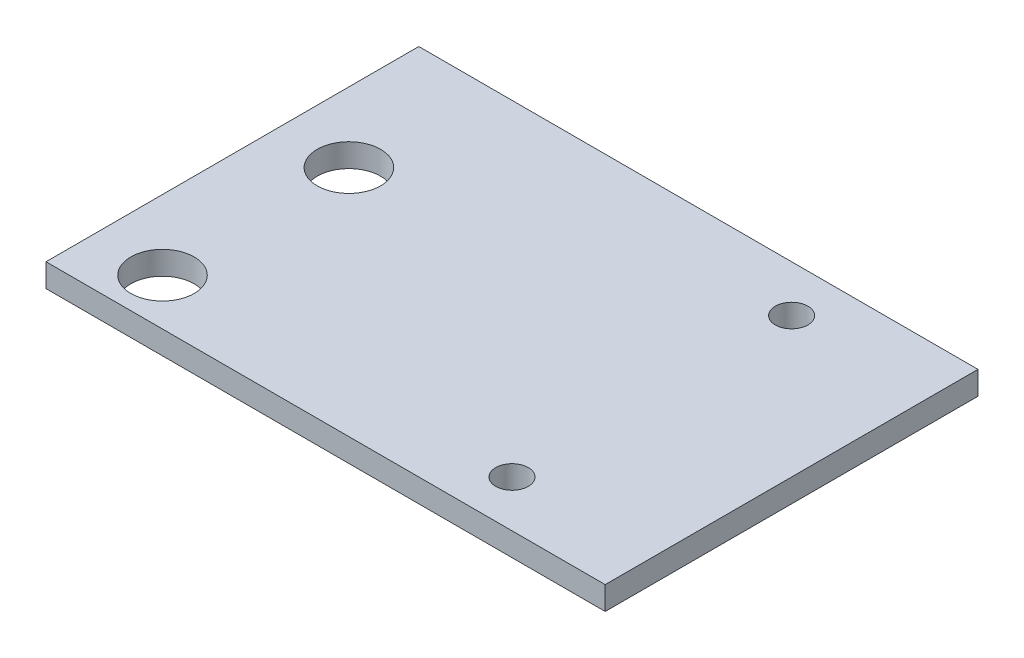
ISO-10303-21;
HEADER;
FILE_DESCRIPTION(('STEP AP214'),'2;1');
FILE_NAME('part.step','',(''),(''),'','','');
FILE_SCHEMA(('AUTOMOTIVE_DESIGN { 1 0 10303 214 1 1 1 1 }'));
ENDSEC;
DATA;
#1=APPLICATION_CONTEXT('core data for automotive mechanical design processes');
#2=APPLICATION_PROTOCOL_DEFINITION('international standard','automotive_design',2000,#1);
#3=PRODUCT_CONTEXT('',#1,'mechanical');
#4=PRODUCT('Part','Part','',(#3));
#5=PRODUCT_RELATED_PRODUCT_CATEGORY('part','',(#4));
#6=PRODUCT_DEFINITION_FORMATION('','',#4);
#7=PRODUCT_DEFINITION_CONTEXT('part definition',#1,'design');
#8=PRODUCT_DEFINITION('design','',#6,#7);
#9=PRODUCT_DEFINITION_SHAPE('','',#8);
#10=(LENGTH_UNIT() NAMED_UNIT(*) SI_UNIT(.MILLI.,.METRE.));
#11=(NAMED_UNIT(*) PLANE_ANGLE_UNIT() SI_UNIT($,.RADIAN.));
#12=(NAMED_UNIT(*) SI_UNIT($,.STERADIAN.) SOLID_ANGLE_UNIT());
#13=UNCERTAINTY_MEASURE_WITH_UNIT(LENGTH_MEASURE(1.E-05),#10,'distance_accuracy_value','');
#14=(GEOMETRIC_REPRESENTATION_CONTEXT(3) GLOBAL_UNCERTAINTY_ASSIGNED_CONTEXT((#13)) GLOBAL_UNIT_ASSIGNED_CONTEXT((#10,
#11,#12)) REPRESENTATION_CONTEXT('',''));
#15=CARTESIAN_POINT('',(0.,0.,0.));
#16=DIRECTION('',(0.,0.,1.));
#17=DIRECTION('',(1.,0.,0.));
#18=AXIS2_PLACEMENT_3D('',#15,#16,#17);
#19=CARTESIAN_POINT('',(0.,-2.5,-40.));
#20=DIRECTION('',(0.,-1.,0.));
#21=DIRECTION('',(0.,0.,-1.));
#22=AXIS2_PLACEMENT_3D('',#19,#20,#21);
#23=PLANE('',#22);
#24=CARTESIAN_POINT('',(45.,-2.49999999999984,-35.0000000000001));
#25=DIRECTION('',(0.,-1.,0.));
#26=DIRECTION('',(0.,0.,-1.));
#27=AXIS2_PLACEMENT_3D('',#24,#25,#26);
#28=CIRCLE('',#27,1.75);
#29=CARTESIAN_POINT('',(45.,-2.49999999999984,-36.7500000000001));
#30=VERTEX_POINT('',#29);
#31=EDGE_CURVE('E165',#30,#30,#28,.F.);
#32=ORIENTED_EDGE('',*,*,#31,.T.);
#33=EDGE_LOOP('',(#32));
#34=FACE_BOUND('',#33,.T.);
#35=CARTESIAN_POINT('',(45.,-2.5,-5.));
#36=DIRECTION('',(0.,-1.,0.));
#37=DIRECTION('',(0.,0.,-1.));
#38=AXIS2_PLACEMENT_3D('',#35,#36,#37);
#39=CIRCLE('',#38,1.75);
#40=CARTESIAN_POINT('',(45.,-2.5,-6.75000000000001));
#41=VERTEX_POINT('',#40);
#42=EDGE_CURVE('E158',#41,#41,#39,.F.);
#43=ORIENTED_EDGE('',*,*,#42,.T.);
#44=EDGE_LOOP('',(#43));
#45=FACE_BOUND('',#44,.T.);
#46=CARTESIAN_POINT('',(7.50000000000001,-2.5,-25.0000000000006));
#47=DIRECTION('',(0.,-1.,0.));
#48=DIRECTION('',(0.,0.,-1.));
#49=AXIS2_PLACEMENT_3D('',#46,#47,#48);
#50=CIRCLE('',#49,3.4);
#51=CARTESIAN_POINT('',(7.50000000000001,-2.5,-28.4000000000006));
#52=VERTEX_POINT('',#51);
#53=EDGE_CURVE('E147',#52,#52,#50,.F.);
#54=ORIENTED_EDGE('',*,*,#53,.T.);
#55=EDGE_LOOP('',(#54));
#56=FACE_BOUND('',#55,.T.);
#57=CARTESIAN_POINT('',(7.49999999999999,-2.5,-5.));
#58=DIRECTION('',(0.,-1.,0.));
#59=DIRECTION('',(0.,0.,-1.));
#60=AXIS2_PLACEMENT_3D('',#57,#58,#59);
#61=CIRCLE('',#60,3.4);
#62=CARTESIAN_POINT('',(7.49999999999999,-2.5,-8.4));
#63=VERTEX_POINT('',#62);
#64=EDGE_CURVE('E126',#63,#63,#61,.F.);
#65=ORIENTED_EDGE('',*,*,#64,.T.);
#66=EDGE_LOOP('',(#65));
#67=FACE_BOUND('',#66,.T.);
#68=DIRECTION('',(1.,0.,0.));
#69=VECTOR('',#68,1.);
#70=CARTESIAN_POINT('',(0.,-2.5,0.));
#71=LINE('',#70,#69);
#72=CARTESIAN_POINT('',(0.,-2.5,0.));
#73=VERTEX_POINT('',#72);
#74=CARTESIAN_POINT('',(60.,-2.5,0.));
#75=VERTEX_POINT('',#74);
#76=EDGE_CURVE('E100',#73,#75,#71,.T.);
#77=ORIENTED_EDGE('',*,*,#76,.F.);
#78=DIRECTION('',(0.,0.,1.));
#79=VECTOR('',#78,1.);
#80=CARTESIAN_POINT('',(0.,-2.5,-40.));
#81=LINE('',#80,#79);
#82=CARTESIAN_POINT('',(0.,-2.5,-40.));
#83=VERTEX_POINT('',#82);
#84=EDGE_CURVE('E11',#83,#73,#81,.T.);
#85=ORIENTED_EDGE('',*,*,#84,.F.);
#86=DIRECTION('',(1.,0.,0.));
#87=VECTOR('',#86,1.);
#88=CARTESIAN_POINT('',(0.,-2.5,-40.));
#89=LINE('',#88,#87);
#90=CARTESIAN_POINT('',(60.,-2.49999999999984,-40.));
#91=VERTEX_POINT('',#90);
#92=EDGE_CURVE('E101',#83,#91,#89,.T.);
#93=ORIENTED_EDGE('',*,*,#92,.T.);
#94=DIRECTION('',(0.,0.,1.));
#95=VECTOR('',#94,1.);
#96=CARTESIAN_POINT('',(60.,-2.49999999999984,-40.));
#97=LINE('',#96,#95);
#98=EDGE_CURVE('E61',#91,#75,#97,.T.);
#99=ORIENTED_EDGE('',*,*,#98,.T.);
#100=EDGE_LOOP('',(#77,#85,#93,#99));
#101=FACE_BOUND('',#100,.T.);
#102=ADVANCED_FACE('F58',(#34,#45,#56,#67,#101),#23,.T.);
#103=CARTESIAN_POINT('',(0.,-2.5,-40.));
#104=DIRECTION('',(1.,0.,0.));
#105=DIRECTION('',(0.,0.,-1.));
#106=AXIS2_PLACEMENT_3D('',#103,#104,#105);
#107=PLANE('',#106);
#108=DIRECTION('',(0.,1.,0.));
#109=VECTOR('',#108,1.);
#110=CARTESIAN_POINT('',(0.,-2.5,0.));
#111=LINE('',#110,#109);
#112=CARTESIAN_POINT('',(0.,0.,0.));
#113=VERTEX_POINT('',#112);
#114=EDGE_CURVE('E118',#73,#113,#111,.T.);
#115=ORIENTED_EDGE('',*,*,#114,.T.);
#116=DIRECTION('',(0.,0.,1.));
#117=VECTOR('',#116,1.);
#118=CARTESIAN_POINT('',(0.,0.,-40.));
#119=LINE('',#118,#117);
#120=CARTESIAN_POINT('',(0.,0.,-40.));
#121=VERTEX_POINT('',#120);
#122=EDGE_CURVE('E67',#121,#113,#119,.T.);
#123=ORIENTED_EDGE('',*,*,#122,.F.);
#124=DIRECTION('',(0.,1.,0.));
#125=VECTOR('',#124,1.);
#126=CARTESIAN_POINT('',(0.,-2.5,-40.));
#127=LINE('',#126,#125);
#128=EDGE_CURVE('E80',#83,#121,#127,.T.);
#129=ORIENTED_EDGE('',*,*,#128,.F.);
#130=ORIENTED_EDGE('',*,*,#84,.T.);
#131=EDGE_LOOP('',(#115,#123,#129,#130));
#132=FACE_BOUND('',#131,.T.);
#133=ADVANCED_FACE('F178',(#132),#107,.F.);
#134=CARTESIAN_POINT('',(0.,0.,-40.));
#135=DIRECTION('',(0.,-1.,0.));
#136=DIRECTION('',(0.,0.,-1.));
#137=AXIS2_PLACEMENT_3D('',#134,#135,#136);
#138=PLANE('',#137);
#139=CARTESIAN_POINT('',(45.,1.66533453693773E-13,-35.0000000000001));
#140=DIRECTION('',(0.,1.,0.));
#141=DIRECTION('',(0.,0.,1.));
#142=AXIS2_PLACEMENT_3D('',#139,#140,#141);
#143=CIRCLE('',#142,1.75);
#144=CARTESIAN_POINT('',(45.,1.66533453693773E-13,-33.2500000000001));
#145=VERTEX_POINT('',#144);
#146=EDGE_CURVE('E163',#145,#145,#143,.T.);
#147=ORIENTED_EDGE('',*,*,#146,.F.);
#148=EDGE_LOOP('',(#147));
#149=FACE_BOUND('',#148,.T.);
#150=CARTESIAN_POINT('',(45.,0.,-5.));
#151=DIRECTION('',(0.,1.,0.));
#152=DIRECTION('',(0.,0.,1.));
#153=AXIS2_PLACEMENT_3D('',#150,#151,#152);
#154=CIRCLE('',#153,1.75);
#155=CARTESIAN_POINT('',(45.,0.,-3.25));
#156=VERTEX_POINT('',#155);
#157=EDGE_CURVE('E150',#156,#156,#154,.T.);
#158=ORIENTED_EDGE('',*,*,#157,.F.);
#159=EDGE_LOOP('',(#158));
#160=FACE_BOUND('',#159,.T.);
#161=CARTESIAN_POINT('',(7.49999999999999,0.,-25.0000000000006));
#162=DIRECTION('',(0.,1.,0.));
#163=DIRECTION('',(0.,0.,1.));
#164=AXIS2_PLACEMENT_3D('',#161,#162,#163);
#165=CIRCLE('',#164,3.4);
#166=CARTESIAN_POINT('',(7.49999999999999,0.,-21.6000000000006));
#167=VERTEX_POINT('',#166);
#168=EDGE_CURVE('E149',#167,#167,#165,.T.);
#169=ORIENTED_EDGE('',*,*,#168,.F.);
#170=EDGE_LOOP('',(#169));
#171=FACE_BOUND('',#170,.T.);
#172=CARTESIAN_POINT('',(7.49999999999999,0.,-5.));
#173=DIRECTION('',(0.,1.,0.));
#174=DIRECTION('',(0.,0.,1.));
#175=AXIS2_PLACEMENT_3D('',#172,#173,#174);
#176=CIRCLE('',#175,3.4);
#177=CARTESIAN_POINT('',(7.49999999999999,0.,-1.6));
#178=VERTEX_POINT('',#177);
#179=EDGE_CURVE('E120',#178,#178,#176,.T.);
#180=ORIENTED_EDGE('',*,*,#179,.F.);
#181=EDGE_LOOP('',(#180));
#182=FACE_BOUND('',#181,.T.);
#183=DIRECTION('',(1.,0.,0.));
#184=VECTOR('',#183,1.);
#185=CARTESIAN_POINT('',(0.,0.,0.));
#186=LINE('',#185,#184);
#187=CARTESIAN_POINT('',(60.,0.,0.));
#188=VERTEX_POINT('',#187);
#189=EDGE_CURVE('E114',#113,#188,#186,.T.);
#190=ORIENTED_EDGE('',*,*,#189,.T.);
#191=DIRECTION('',(0.,0.,1.));
#192=VECTOR('',#191,1.);
#193=CARTESIAN_POINT('',(60.,1.66533453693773E-13,-40.));
#194=LINE('',#193,#192);
#195=CARTESIAN_POINT('',(60.,1.66533453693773E-13,-40.));
#196=VERTEX_POINT('',#195);
#197=EDGE_CURVE('E105',#196,#188,#194,.T.);
#198=ORIENTED_EDGE('',*,*,#197,.F.);
#199=DIRECTION('',(1.,0.,0.));
#200=VECTOR('',#199,1.);
#201=CARTESIAN_POINT('',(0.,0.,-40.));
#202=LINE('',#201,#200);
#203=EDGE_CURVE('E138',#121,#196,#202,.T.);
#204=ORIENTED_EDGE('',*,*,#203,.F.);
#205=ORIENTED_EDGE('',*,*,#122,.T.);
#206=EDGE_LOOP('',(#190,#198,#204,#205));
#207=FACE_BOUND('',#206,.T.);
#208=ADVANCED_FACE('F175',(#149,#160,#171,#182,#207),#138,.F.);
#209=CARTESIAN_POINT('',(60.,1.66533453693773E-13,-40.));
#210=DIRECTION('',(-1.,0.,0.));
#211=DIRECTION('',(0.,0.,1.));
#212=AXIS2_PLACEMENT_3D('',#209,#210,#211);
#213=PLANE('',#212);
#214=DIRECTION('',(0.,-1.,0.));
#215=VECTOR('',#214,1.);
#216=CARTESIAN_POINT('',(60.,0.,0.));
#217=LINE('',#216,#215);
#218=EDGE_CURVE('E108',#188,#75,#217,.T.);
#219=ORIENTED_EDGE('',*,*,#218,.T.);
#220=ORIENTED_EDGE('',*,*,#98,.F.);
#221=DIRECTION('',(0.,-1.,0.));
#222=VECTOR('',#221,1.);
#223=CARTESIAN_POINT('',(60.,1.66533453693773E-13,-40.));
#224=LINE('',#223,#222);
#225=EDGE_CURVE('E136',#196,#91,#224,.T.);
#226=ORIENTED_EDGE('',*,*,#225,.F.);
#227=ORIENTED_EDGE('',*,*,#197,.T.);
#228=EDGE_LOOP('',(#219,#220,#226,#227));
#229=FACE_BOUND('',#228,.T.);
#230=ADVANCED_FACE('F109',(#229),#213,.F.);
#231=CARTESIAN_POINT('',(60.,-2.49999999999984,-40.));
#232=DIRECTION('',(0.,0.,-1.));
#233=DIRECTION('',(-1.,0.,0.));
#234=AXIS2_PLACEMENT_3D('',#231,#232,#233);
#235=PLANE('',#234);
#236=ORIENTED_EDGE('',*,*,#92,.F.);
#237=ORIENTED_EDGE('',*,*,#128,.T.);
#238=ORIENTED_EDGE('',*,*,#203,.T.);
#239=ORIENTED_EDGE('',*,*,#225,.T.);
#240=EDGE_LOOP('',(#236,#237,#238,#239));
#241=FACE_BOUND('',#240,.T.);
#242=ADVANCED_FACE('F188',(#241),#235,.T.);
#243=CARTESIAN_POINT('',(60.,-2.5,0.));
#244=DIRECTION('',(0.,0.,-1.));
#245=DIRECTION('',(-1.,0.,0.));
#246=AXIS2_PLACEMENT_3D('',#243,#244,#245);
#247=PLANE('',#246);
#248=ORIENTED_EDGE('',*,*,#76,.T.);
#249=ORIENTED_EDGE('',*,*,#218,.F.);
#250=ORIENTED_EDGE('',*,*,#189,.F.);
#251=ORIENTED_EDGE('',*,*,#114,.F.);
#252=EDGE_LOOP('',(#248,#249,#250,#251));
#253=FACE_BOUND('',#252,.T.);
#254=ADVANCED_FACE('F117',(#253),#247,.F.);
#255=CARTESIAN_POINT('',(7.49999999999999,-2.50099999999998,-5.));
#256=DIRECTION('',(0.,1.,0.));
#257=DIRECTION('',(0.,0.,1.));
#258=AXIS2_PLACEMENT_3D('',#255,#256,#257);
#259=CYLINDRICAL_SURFACE('',#258,3.4);
#260=ORIENTED_EDGE('',*,*,#64,.F.);
#261=EDGE_LOOP('',(#260));
#262=FACE_BOUND('',#261,.T.);
#263=ORIENTED_EDGE('',*,*,#179,.T.);
#264=EDGE_LOOP('',(#263));
#265=FACE_BOUND('',#264,.T.);
#266=ADVANCED_FACE('F195',(#262,#265),#259,.F.);
#267=CARTESIAN_POINT('',(7.50000000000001,-2.50099999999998,-25.0000000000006));
#268=DIRECTION('',(0.,1.,0.));
#269=DIRECTION('',(0.,0.,1.));
#270=AXIS2_PLACEMENT_3D('',#267,#268,#269);
#271=CYLINDRICAL_SURFACE('',#270,3.4);
#272=ORIENTED_EDGE('',*,*,#53,.F.);
#273=EDGE_LOOP('',(#272));
#274=FACE_BOUND('',#273,.T.);
#275=ORIENTED_EDGE('',*,*,#168,.T.);
#276=EDGE_LOOP('',(#275));
#277=FACE_BOUND('',#276,.T.);
#278=ADVANCED_FACE('F213',(#274,#277),#271,.F.);
#279=CARTESIAN_POINT('',(45.,-2.50099999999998,-5.));
#280=DIRECTION('',(0.,1.,0.));
#281=DIRECTION('',(0.,0.,1.));
#282=AXIS2_PLACEMENT_3D('',#279,#280,#281);
#283=CYLINDRICAL_SURFACE('',#282,1.75);
#284=ORIENTED_EDGE('',*,*,#42,.F.);
#285=EDGE_LOOP('',(#284));
#286=FACE_BOUND('',#285,.T.);
#287=ORIENTED_EDGE('',*,*,#157,.T.);
#288=EDGE_LOOP('',(#287));
#289=FACE_BOUND('',#288,.T.);
#290=ADVANCED_FACE('F218',(#286,#289),#283,.F.);
#291=CARTESIAN_POINT('',(45.,-2.50099999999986,-35.0000000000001));
#292=DIRECTION('',(0.,1.,0.));
#293=DIRECTION('',(0.,0.,1.));
#294=AXIS2_PLACEMENT_3D('',#291,#292,#293);
#295=CYLINDRICAL_SURFACE('',#294,1.75);
#296=ORIENTED_EDGE('',*,*,#31,.F.);
#297=EDGE_LOOP('',(#296));
#298=FACE_BOUND('',#297,.T.);
#299=ORIENTED_EDGE('',*,*,#146,.T.);
#300=EDGE_LOOP('',(#299));
#301=FACE_BOUND('',#300,.T.);
#302=ADVANCED_FACE('F173',(#298,#301),#295,.F.);
#303=CLOSED_SHELL('',(#102,#133,#208,#230,#242,#254,#266,#278,#290,#302));
#304=MANIFOLD_SOLID_BREP('B2',#303);
#305=ADVANCED_BREP_SHAPE_REPRESENTATION('',(#18,#304),#14);
#306=SHAPE_DEFINITION_REPRESENTATION(#9,#305);
ENDSEC;
END-ISO-10303-21;
